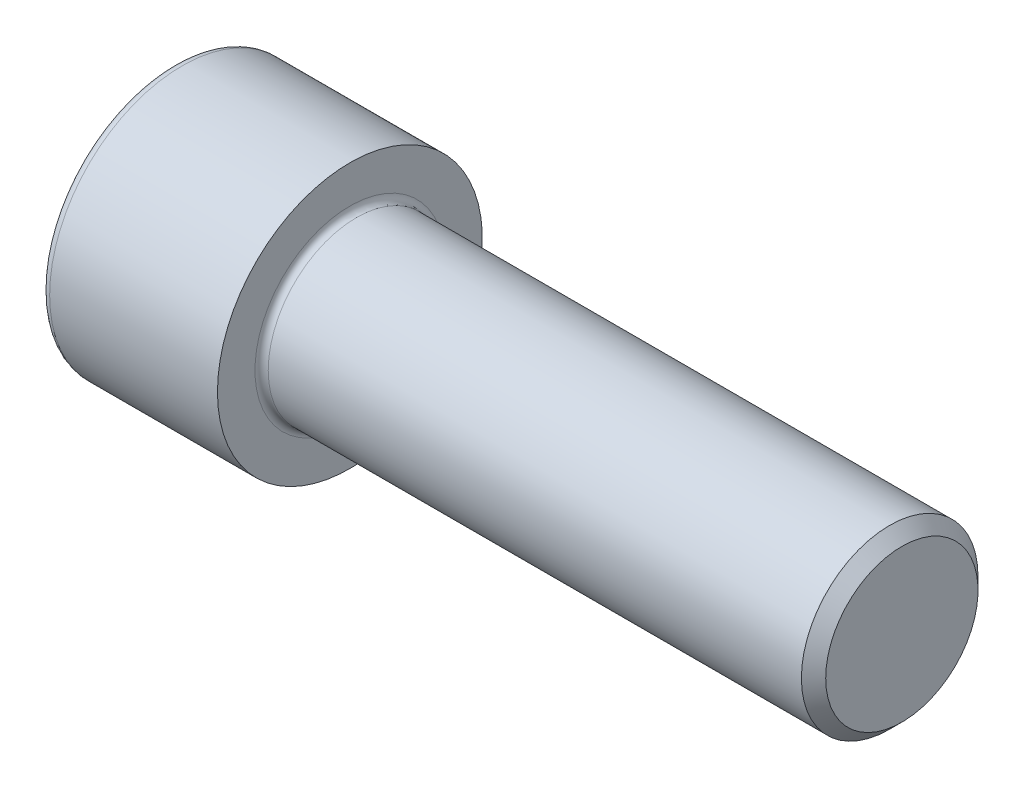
from build123d import *

# Parameters (mm, degrees)
FILLET1_R   = 0.6
FILLET2_R   = 0.8
HEX_2_DEPTH = 8


with BuildPart() as part:
    # BodySke → Base-Revolve (revolve)
    with BuildSketch(Plane.XY, mode=Mode.PRIVATE) as base_revolve_sk:
        Polygon((0, 0), (0, 12), (16, 12), (16, 8), (64.8985, 8), (66, 6.8985), (66, 0), align=None)
    revolve(base_revolve_sk.sketch.rotate(Axis((-31.75, 0, 0), (1, 0, 0)), 90), axis=Axis((-31.75, 0, 0), (1, 0, 0)))

    # Fillet1
    fillet1_edges = [part.edges().sort_by_distance(p)[0] for p in [
        (16, 0, -8),
    ]]
    fillet(fillet1_edges, radius=FILLET1_R)

    # Fillet2
    fillet2_edges = [part.edges().sort_by_distance(p)[0] for p in [
        (0, 0, -12),
    ]]
    fillet(fillet2_edges, radius=FILLET2_R)

    # Sketch2 → Hex-PreBroach (revolve, cut)
    with BuildSketch(Plane.XY, mode=Mode.PRIVATE) as hex_prebroach_sk:
        Polygon((0, 7.071), (8, 7.071), (12.082443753, 0), (0, 0), align=None)
    revolve(hex_prebroach_sk.sketch.rotate(Axis((0, 0, 0), (1, 0, 0)), 90), axis=Axis((0, 0, 0), (1, 0, 0)), mode=Mode.SUBTRACT)

    # Sketch3 → Hex 2 (cut)
    with BuildSketch(Plane(origin=(0, 0, 0), x_dir=(0, 0.500000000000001, 0.866025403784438), z_dir=(-1, 0, 0))):
        Polygon((4.082443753, 7.071), (-4.082443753, 7.071), (-8.164887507, 0), (-4.082443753, -7.071), (4.082443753, -7.071), (8.164887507, 0), align=None)
    extrude(amount=-HEX_2_DEPTH, mode=Mode.SUBTRACT)


solid = part.part
